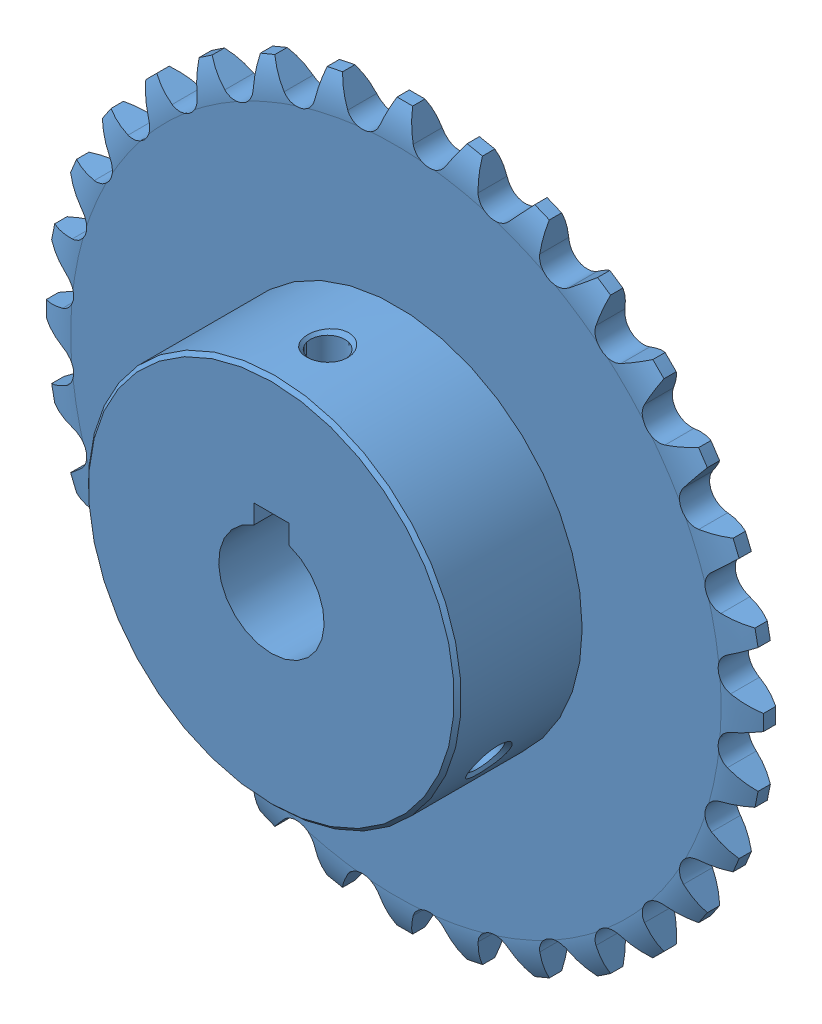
SolidWorks assembly SP35B32-N-15.SLDASM, configuration Default (file format 12000). Lengths in mm.
Overall size (102 102 22.63).
3 component instances, 2 part files, 0 mates.
Components (placement in the parent):
- _SP35B32-N-15_b_1-1: _SP35B32-N-15_b_1.sldprt [Default] at origin size (102 102 22.63)
- _SET-SCREW6-6_1-1: _SET-SCREW6-6_1.sldprt [Default] at (0 9.8 14) x (0 -1 0) z (-1 0 0) size (6 6 6)
- _SET-SCREW6-6_1-2: _SET-SCREW6-6_1.sldprt [Default] at (6.4952 -3.75 14) x (-0.866025 0.5 0) z (0.5 0.866025 0) size (6 6 6)
